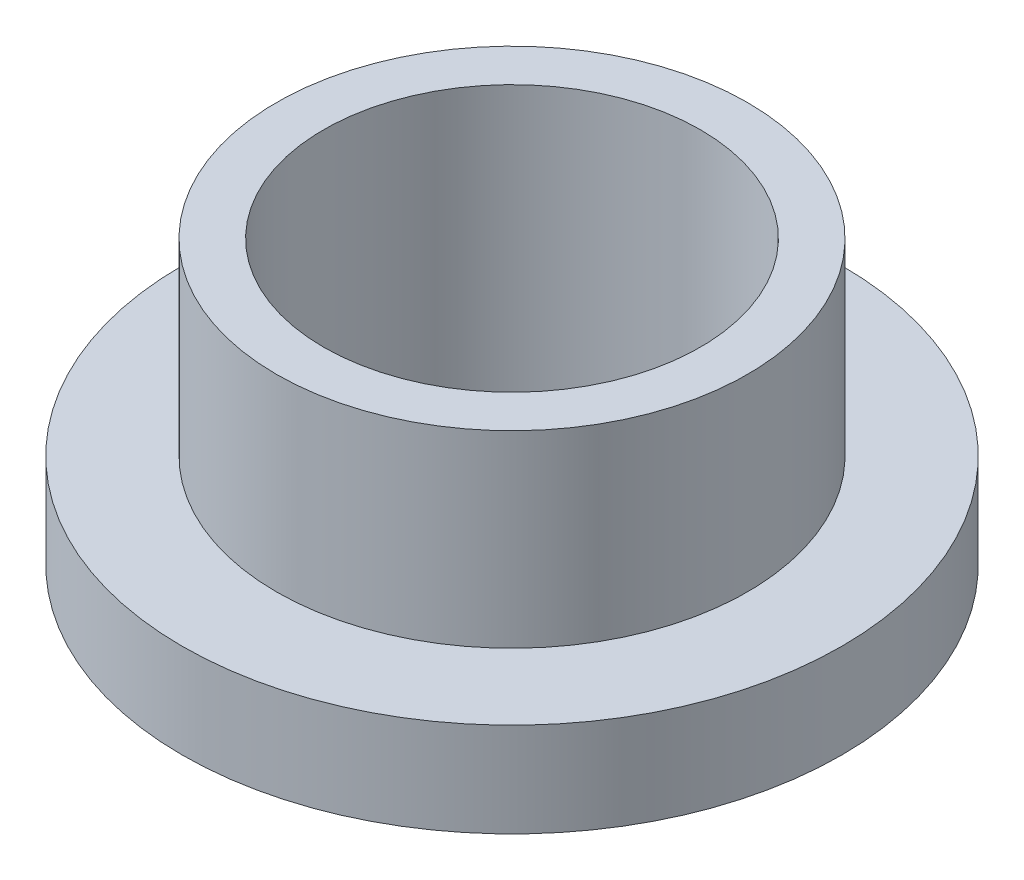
from build123d import *

# Parameters (mm, degrees)
SKETCH1_R           = 7.9375
SKETCH1_R_2         = 6.35
BOSS_EXTRUDE1_DEPTH = 9.525
SKETCH2_R           = 11.1125
SKETCH2_R_2         = 6.35
BOSS_EXTRUDE2_DEPTH = 3.175


with BuildPart() as part:
    # Sketch1 → Boss-Extrude1 (new body)
    with BuildSketch(Plane(origin=(0, 0, 0), x_dir=(1, 0, 0), z_dir=(0, 1, 0))):
        with Locations(Location((0, 0, 0), (0, 0, 90))):
            Circle(SKETCH1_R)
        with Locations(Location((0, 0, 0), (0, 0, 90))):
            Circle(SKETCH1_R_2, mode=Mode.SUBTRACT)
    extrude(amount=BOSS_EXTRUDE1_DEPTH)

    # Sketch2 → Boss-Extrude2 (add)
    with BuildSketch(Plane.XZ):
        with Locations(Location((0, 0, 0), (0, 0, 270))):
            Circle(SKETCH2_R)
        with Locations(Location((0, 0, 0), (0, 0, 270))):
            Circle(SKETCH2_R_2, mode=Mode.SUBTRACT)
    extrude(amount=-BOSS_EXTRUDE2_DEPTH)


solid = part.part
